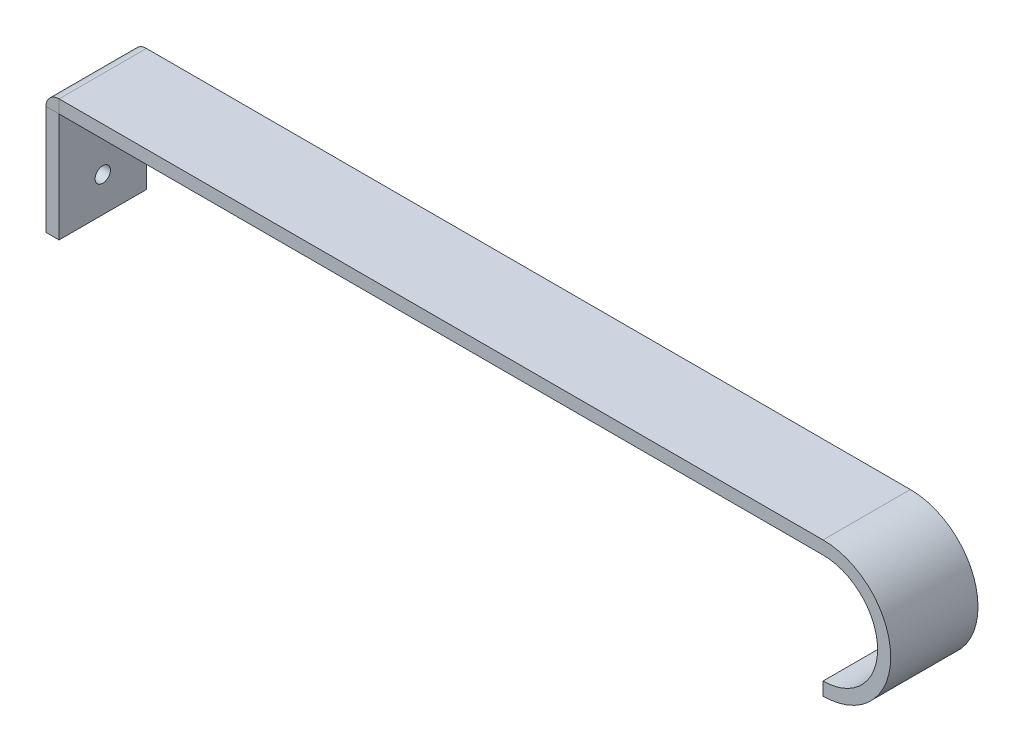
ISO-10303-21;
HEADER;
FILE_DESCRIPTION(('STEP AP214'),'2;1');
FILE_NAME('part.step','',(''),(''),'','','');
FILE_SCHEMA(('AUTOMOTIVE_DESIGN { 1 0 10303 214 1 1 1 1 }'));
ENDSEC;
DATA;
#1=APPLICATION_CONTEXT('core data for automotive mechanical design processes');
#2=APPLICATION_PROTOCOL_DEFINITION('international standard','automotive_design',2000,#1);
#3=PRODUCT_CONTEXT('',#1,'mechanical');
#4=PRODUCT('Part','Part','',(#3));
#5=PRODUCT_RELATED_PRODUCT_CATEGORY('part','',(#4));
#6=PRODUCT_DEFINITION_FORMATION('','',#4);
#7=PRODUCT_DEFINITION_CONTEXT('part definition',#1,'design');
#8=PRODUCT_DEFINITION('design','',#6,#7);
#9=PRODUCT_DEFINITION_SHAPE('','',#8);
#10=(LENGTH_UNIT() NAMED_UNIT(*) SI_UNIT(.MILLI.,.METRE.));
#11=(NAMED_UNIT(*) PLANE_ANGLE_UNIT() SI_UNIT($,.RADIAN.));
#12=(NAMED_UNIT(*) SI_UNIT($,.STERADIAN.) SOLID_ANGLE_UNIT());
#13=UNCERTAINTY_MEASURE_WITH_UNIT(LENGTH_MEASURE(1.E-05),#10,'distance_accuracy_value','');
#14=(GEOMETRIC_REPRESENTATION_CONTEXT(3) GLOBAL_UNCERTAINTY_ASSIGNED_CONTEXT((#13)) GLOBAL_UNIT_ASSIGNED_CONTEXT((#10,
#11,#12)) REPRESENTATION_CONTEXT('',''));
#15=CARTESIAN_POINT('',(0.,0.,0.));
#16=DIRECTION('',(0.,0.,1.));
#17=DIRECTION('',(1.,0.,0.));
#18=AXIS2_PLACEMENT_3D('',#15,#16,#17);
#19=CARTESIAN_POINT('',(22.0000000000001,-24.9999957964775,-20.));
#20=DIRECTION('',(1.,0.,0.));
#21=DIRECTION('',(0.,0.,-1.));
#22=AXIS2_PLACEMENT_3D('',#19,#20,#21);
#23=PLANE('',#22);
#24=CARTESIAN_POINT('',(22.0000000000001,-16.9999957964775,-10.));
#25=DIRECTION('',(-1.,0.,0.));
#26=DIRECTION('',(0.,0.,1.));
#27=AXIS2_PLACEMENT_3D('',#24,#25,#26);
#28=CIRCLE('',#27,1.75);
#29=CARTESIAN_POINT('',(22.0000000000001,-16.9999957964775,-8.25));
#30=VERTEX_POINT('',#29);
#31=EDGE_CURVE('E110',#30,#30,#28,.T.);
#32=ORIENTED_EDGE('',*,*,#31,.F.);
#33=EDGE_LOOP('',(#32));
#34=FACE_BOUND('',#33,.T.);
#35=CARTESIAN_POINT('',(22.,-4.99999579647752,-10.));
#36=DIRECTION('',(-1.,0.,0.));
#37=DIRECTION('',(0.,0.,1.));
#38=AXIS2_PLACEMENT_3D('',#35,#36,#37);
#39=CIRCLE('',#38,1.75);
#40=CARTESIAN_POINT('',(22.,-4.99999579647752,-8.25));
#41=VERTEX_POINT('',#40);
#42=EDGE_CURVE('E189',#41,#41,#39,.T.);
#43=ORIENTED_EDGE('',*,*,#42,.F.);
#44=EDGE_LOOP('',(#43));
#45=FACE_BOUND('',#44,.T.);
#46=DIRECTION('',(0.,1.,0.));
#47=VECTOR('',#46,1.);
#48=CARTESIAN_POINT('',(22.0000000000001,-24.9999957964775,0.));
#49=LINE('',#48,#47);
#50=CARTESIAN_POINT('',(22.0000000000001,-24.9999957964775,0.));
#51=VERTEX_POINT('',#50);
#52=CARTESIAN_POINT('',(22.,-0.000100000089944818,0.));
#53=VERTEX_POINT('',#52);
#54=EDGE_CURVE('E53',#51,#53,#49,.T.);
#55=ORIENTED_EDGE('',*,*,#54,.T.);
#56=DIRECTION('',(0.,0.,-1.));
#57=VECTOR('',#56,1.);
#58=CARTESIAN_POINT('',(22.,-0.000100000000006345,-20.));
#59=LINE('',#58,#57);
#60=CARTESIAN_POINT('',(22.,-0.000100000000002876,-20.));
#61=VERTEX_POINT('',#60);
#62=EDGE_CURVE('E120',#53,#61,#59,.T.);
#63=ORIENTED_EDGE('',*,*,#62,.T.);
#64=DIRECTION('',(0.,-1.,0.));
#65=VECTOR('',#64,1.);
#66=CARTESIAN_POINT('',(22.0000000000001,-24.9999957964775,-20.));
#67=LINE('',#66,#65);
#68=CARTESIAN_POINT('',(22.0000000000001,-24.9999957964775,-20.));
#69=VERTEX_POINT('',#68);
#70=EDGE_CURVE('E75',#61,#69,#67,.T.);
#71=ORIENTED_EDGE('',*,*,#70,.T.);
#72=DIRECTION('',(0.,0.,1.));
#73=VECTOR('',#72,1.);
#74=CARTESIAN_POINT('',(22.0000000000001,-24.9999957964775,0.));
#75=LINE('',#74,#73);
#76=EDGE_CURVE('E96',#69,#51,#75,.T.);
#77=ORIENTED_EDGE('',*,*,#76,.T.);
#78=EDGE_LOOP('',(#55,#63,#71,#77));
#79=FACE_BOUND('',#78,.T.);
#80=ADVANCED_FACE('F49',(#34,#45,#79),#23,.F.);
#81=CARTESIAN_POINT('',(22.0000000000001,-24.9999957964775,0.));
#82=DIRECTION('',(0.,0.,-1.));
#83=DIRECTION('',(0.,-1.,0.));
#84=AXIS2_PLACEMENT_3D('',#81,#82,#83);
#85=PLANE('',#84);
#86=DIRECTION('',(0.,1.,0.));
#87=VECTOR('',#86,1.);
#88=CARTESIAN_POINT('',(25.0000000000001,-24.9999957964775,0.));
#89=LINE('',#88,#87);
#90=CARTESIAN_POINT('',(25.0000000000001,-24.9999957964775,0.));
#91=VERTEX_POINT('',#90);
#92=CARTESIAN_POINT('',(25.,-0.000100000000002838,0.));
#93=VERTEX_POINT('',#92);
#94=EDGE_CURVE('E97',#91,#93,#89,.T.);
#95=ORIENTED_EDGE('',*,*,#94,.T.);
#96=DIRECTION('',(-1.,0.,0.));
#97=VECTOR('',#96,1.);
#98=CARTESIAN_POINT('',(22.,-0.000100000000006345,0.));
#99=LINE('',#98,#97);
#100=EDGE_CURVE('E122',#93,#53,#99,.T.);
#101=ORIENTED_EDGE('',*,*,#100,.T.);
#102=ORIENTED_EDGE('',*,*,#54,.F.);
#103=DIRECTION('',(1.,0.,0.));
#104=VECTOR('',#103,1.);
#105=CARTESIAN_POINT('',(22.0000000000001,-24.9999957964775,0.));
#106=LINE('',#105,#104);
#107=EDGE_CURVE('E104',#51,#91,#106,.T.);
#108=ORIENTED_EDGE('',*,*,#107,.T.);
#109=EDGE_LOOP('',(#95,#101,#102,#108));
#110=FACE_BOUND('',#109,.T.);
#111=ADVANCED_FACE('F129',(#110),#85,.F.);
#112=CARTESIAN_POINT('',(22.0000000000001,-24.9999957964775,-20.));
#113=DIRECTION('',(0.,0.,1.));
#114=DIRECTION('',(0.,1.,0.));
#115=AXIS2_PLACEMENT_3D('',#112,#113,#114);
#116=PLANE('',#115);
#117=ORIENTED_EDGE('',*,*,#70,.F.);
#118=DIRECTION('',(1.,0.,0.));
#119=VECTOR('',#118,1.);
#120=CARTESIAN_POINT('',(22.,-0.000100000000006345,-20.));
#121=LINE('',#120,#119);
#122=CARTESIAN_POINT('',(25.,-9.99999999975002E-05,-20.));
#123=VERTEX_POINT('',#122);
#124=EDGE_CURVE('E14',#61,#123,#121,.T.);
#125=ORIENTED_EDGE('',*,*,#124,.T.);
#126=DIRECTION('',(0.,-1.,0.));
#127=VECTOR('',#126,1.);
#128=CARTESIAN_POINT('',(25.0000000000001,-24.9999957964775,-20.));
#129=LINE('',#128,#127);
#130=CARTESIAN_POINT('',(25.0000000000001,-24.9999957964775,-20.));
#131=VERTEX_POINT('',#130);
#132=EDGE_CURVE('E88',#123,#131,#129,.T.);
#133=ORIENTED_EDGE('',*,*,#132,.T.);
#134=DIRECTION('',(1.,0.,0.));
#135=VECTOR('',#134,1.);
#136=CARTESIAN_POINT('',(22.0000000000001,-24.9999957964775,-20.));
#137=LINE('',#136,#135);
#138=EDGE_CURVE('E90',#69,#131,#137,.T.);
#139=ORIENTED_EDGE('',*,*,#138,.F.);
#140=EDGE_LOOP('',(#117,#125,#133,#139));
#141=FACE_BOUND('',#140,.T.);
#142=ADVANCED_FACE('F51',(#141),#116,.F.);
#143=CARTESIAN_POINT('',(25.0000000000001,-24.9999957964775,-20.));
#144=DIRECTION('',(1.,0.,0.));
#145=DIRECTION('',(0.,0.,-1.));
#146=AXIS2_PLACEMENT_3D('',#143,#144,#145);
#147=PLANE('',#146);
#148=DIRECTION('',(0.,0.,-1.));
#149=VECTOR('',#148,1.);
#150=CARTESIAN_POINT('',(25.,-9.99999999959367E-05,-20.));
#151=LINE('',#150,#149);
#152=EDGE_CURVE('E58',#93,#123,#151,.T.);
#153=ORIENTED_EDGE('',*,*,#152,.F.);
#154=ORIENTED_EDGE('',*,*,#94,.F.);
#155=DIRECTION('',(0.,0.,1.));
#156=VECTOR('',#155,1.);
#157=CARTESIAN_POINT('',(25.0000000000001,-24.9999957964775,0.));
#158=LINE('',#157,#156);
#159=EDGE_CURVE('E103',#131,#91,#158,.T.);
#160=ORIENTED_EDGE('',*,*,#159,.F.);
#161=ORIENTED_EDGE('',*,*,#132,.F.);
#162=EDGE_LOOP('',(#153,#154,#160,#161));
#163=FACE_BOUND('',#162,.T.);
#164=CARTESIAN_POINT('',(25.0000000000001,-16.9999957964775,-10.));
#165=DIRECTION('',(-1.,0.,0.));
#166=DIRECTION('',(0.,0.,1.));
#167=AXIS2_PLACEMENT_3D('',#164,#165,#166);
#168=CIRCLE('',#167,1.75);
#169=CARTESIAN_POINT('',(25.0000000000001,-16.9999957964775,-8.25000000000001));
#170=VERTEX_POINT('',#169);
#171=EDGE_CURVE('E114',#170,#170,#168,.T.);
#172=ORIENTED_EDGE('',*,*,#171,.T.);
#173=EDGE_LOOP('',(#172));
#174=FACE_BOUND('',#173,.T.);
#175=CARTESIAN_POINT('',(25.,-4.99999579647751,-10.));
#176=DIRECTION('',(-1.,0.,0.));
#177=DIRECTION('',(0.,0.,1.));
#178=AXIS2_PLACEMENT_3D('',#175,#176,#177);
#179=CIRCLE('',#178,1.75);
#180=CARTESIAN_POINT('',(25.,-4.99999579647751,-8.25));
#181=VERTEX_POINT('',#180);
#182=EDGE_CURVE('E165',#181,#181,#179,.T.);
#183=ORIENTED_EDGE('',*,*,#182,.T.);
#184=EDGE_LOOP('',(#183));
#185=FACE_BOUND('',#184,.T.);
#186=ADVANCED_FACE('F106',(#163,#174,#185),#147,.T.);
#187=CARTESIAN_POINT('',(22.0000000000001,-24.9999957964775,0.));
#188=DIRECTION('',(0.,1.,0.));
#189=DIRECTION('',(0.,0.,-1.));
#190=AXIS2_PLACEMENT_3D('',#187,#188,#189);
#191=PLANE('',#190);
#192=ORIENTED_EDGE('',*,*,#159,.T.);
#193=ORIENTED_EDGE('',*,*,#107,.F.);
#194=ORIENTED_EDGE('',*,*,#76,.F.);
#195=ORIENTED_EDGE('',*,*,#138,.T.);
#196=EDGE_LOOP('',(#192,#193,#194,#195));
#197=FACE_BOUND('',#196,.T.);
#198=ADVANCED_FACE('F101',(#197),#191,.F.);
#199=CARTESIAN_POINT('',(22.0000000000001,-16.9999957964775,-10.));
#200=DIRECTION('',(1.,0.,0.));
#201=DIRECTION('',(0.,0.,-1.));
#202=AXIS2_PLACEMENT_3D('',#199,#200,#201);
#203=CYLINDRICAL_SURFACE('',#202,1.75);
#204=ORIENTED_EDGE('',*,*,#31,.T.);
#205=EDGE_LOOP('',(#204));
#206=FACE_BOUND('',#205,.T.);
#207=ORIENTED_EDGE('',*,*,#171,.F.);
#208=EDGE_LOOP('',(#207));
#209=FACE_BOUND('',#208,.T.);
#210=ADVANCED_FACE('F197',(#206,#209),#203,.F.);
#211=CARTESIAN_POINT('',(22.,-4.99999579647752,-10.));
#212=DIRECTION('',(1.,0.,0.));
#213=DIRECTION('',(0.,0.,-1.));
#214=AXIS2_PLACEMENT_3D('',#211,#212,#213);
#215=CYLINDRICAL_SURFACE('',#214,1.75);
#216=ORIENTED_EDGE('',*,*,#42,.T.);
#217=EDGE_LOOP('',(#216));
#218=FACE_BOUND('',#217,.T.);
#219=ORIENTED_EDGE('',*,*,#182,.F.);
#220=EDGE_LOOP('',(#219));
#221=FACE_BOUND('',#220,.T.);
#222=ADVANCED_FACE('F199',(#218,#221),#215,.F.);
#223=CARTESIAN_POINT('',(0.,3.,-20.));
#224=DIRECTION('',(0.,-1.,0.));
#225=DIRECTION('',(0.,0.,-1.));
#226=AXIS2_PLACEMENT_3D('',#223,#224,#225);
#227=PLANE('',#226);
#228=DIRECTION('',(0.,0.,-1.));
#229=VECTOR('',#228,1.);
#230=CARTESIAN_POINT('',(25.0001,3.,-20.));
#231=LINE('',#230,#229);
#232=CARTESIAN_POINT('',(25.0001,3.,0.));
#233=VERTEX_POINT('',#232);
#234=CARTESIAN_POINT('',(25.0001,3.,-20.));
#235=VERTEX_POINT('',#234);
#236=EDGE_CURVE('E187',#233,#235,#231,.T.);
#237=ORIENTED_EDGE('',*,*,#236,.F.);
#238=DIRECTION('',(1.,0.,0.));
#239=VECTOR('',#238,1.);
#240=CARTESIAN_POINT('',(0.,3.,0.));
#241=LINE('',#240,#239);
#242=CARTESIAN_POINT('',(200.,3.00000000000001,0.));
#243=VERTEX_POINT('',#242);
#244=EDGE_CURVE('E176',#233,#243,#241,.T.);
#245=ORIENTED_EDGE('',*,*,#244,.T.);
#246=DIRECTION('',(0.,0.,-1.));
#247=VECTOR('',#246,1.);
#248=CARTESIAN_POINT('',(200.,3.,0.));
#249=LINE('',#248,#247);
#250=CARTESIAN_POINT('',(200.,3.00000000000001,-20.));
#251=VERTEX_POINT('',#250);
#252=EDGE_CURVE('E173',#243,#251,#249,.T.);
#253=ORIENTED_EDGE('',*,*,#252,.T.);
#254=DIRECTION('',(-1.,0.,0.));
#255=VECTOR('',#254,1.);
#256=CARTESIAN_POINT('',(0.,3.,-20.));
#257=LINE('',#256,#255);
#258=EDGE_CURVE('E170',#251,#235,#257,.T.);
#259=ORIENTED_EDGE('',*,*,#258,.T.);
#260=EDGE_LOOP('',(#237,#245,#253,#259));
#261=FACE_BOUND('',#260,.T.);
#262=ADVANCED_FACE('F206',(#261),#227,.F.);
#263=CARTESIAN_POINT('',(0.,3.,0.));
#264=DIRECTION('',(0.,0.,-1.));
#265=DIRECTION('',(-1.,0.,0.));
#266=AXIS2_PLACEMENT_3D('',#263,#264,#265);
#267=PLANE('',#266);
#268=DIRECTION('',(0.,1.,0.));
#269=VECTOR('',#268,1.);
#270=CARTESIAN_POINT('',(25.0001,3.,0.));
#271=LINE('',#270,#269);
#272=CARTESIAN_POINT('',(25.0001,0.,0.));
#273=VERTEX_POINT('',#272);
#274=EDGE_CURVE('E182',#273,#233,#271,.T.);
#275=ORIENTED_EDGE('',*,*,#274,.F.);
#276=DIRECTION('',(1.,0.,0.));
#277=VECTOR('',#276,1.);
#278=CARTESIAN_POINT('',(0.,0.,0.));
#279=LINE('',#278,#277);
#280=CARTESIAN_POINT('',(200.,0.,0.));
#281=VERTEX_POINT('',#280);
#282=EDGE_CURVE('E167',#273,#281,#279,.T.);
#283=ORIENTED_EDGE('',*,*,#282,.T.);
#284=CARTESIAN_POINT('',(200.,-12.4999978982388,0.));
#285=DIRECTION('',(0.,0.,-1.));
#286=DIRECTION('',(1.,0.,0.));
#287=AXIS2_PLACEMENT_3D('',#284,#285,#286);
#288=CIRCLE('',#287,12.4999978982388);
#289=CARTESIAN_POINT('',(200.,-24.9999957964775,0.));
#290=VERTEX_POINT('',#289);
#291=EDGE_CURVE('E417',#281,#290,#288,.T.);
#292=ORIENTED_EDGE('',*,*,#291,.T.);
#293=DIRECTION('',(0.,-1.,0.));
#294=VECTOR('',#293,1.);
#295=CARTESIAN_POINT('',(200.,-24.9999957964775,0.));
#296=LINE('',#295,#294);
#297=CARTESIAN_POINT('',(200.,-27.9999957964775,0.));
#298=VERTEX_POINT('',#297);
#299=EDGE_CURVE('E414',#290,#298,#296,.T.);
#300=ORIENTED_EDGE('',*,*,#299,.T.);
#301=CARTESIAN_POINT('',(200.,-12.4999978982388,0.));
#302=DIRECTION('',(0.,0.,1.));
#303=DIRECTION('',(1.,0.,0.));
#304=AXIS2_PLACEMENT_3D('',#301,#302,#303);
#305=CIRCLE('',#304,15.4999978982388);
#306=EDGE_CURVE('E410',#298,#243,#305,.T.);
#307=ORIENTED_EDGE('',*,*,#306,.T.);
#308=ORIENTED_EDGE('',*,*,#244,.F.);
#309=EDGE_LOOP('',(#275,#283,#292,#300,#307,#308));
#310=FACE_BOUND('',#309,.T.);
#311=ADVANCED_FACE('F265',(#310),#267,.F.);
#312=CARTESIAN_POINT('',(0.,0.,-20.));
#313=DIRECTION('',(0.,-1.,0.));
#314=DIRECTION('',(0.,0.,-1.));
#315=AXIS2_PLACEMENT_3D('',#312,#313,#314);
#316=PLANE('',#315);
#317=ORIENTED_EDGE('',*,*,#282,.F.);
#318=DIRECTION('',(0.,0.,-1.));
#319=VECTOR('',#318,1.);
#320=CARTESIAN_POINT('',(25.0001,0.,-20.));
#321=LINE('',#320,#319);
#322=CARTESIAN_POINT('',(25.0001,0.,-20.));
#323=VERTEX_POINT('',#322);
#324=EDGE_CURVE('E151',#273,#323,#321,.T.);
#325=ORIENTED_EDGE('',*,*,#324,.T.);
#326=DIRECTION('',(-1.,0.,0.));
#327=VECTOR('',#326,1.);
#328=CARTESIAN_POINT('',(0.,0.,-20.));
#329=LINE('',#328,#327);
#330=CARTESIAN_POINT('',(200.,0.,-20.));
#331=VERTEX_POINT('',#330);
#332=EDGE_CURVE('E162',#331,#323,#329,.T.);
#333=ORIENTED_EDGE('',*,*,#332,.F.);
#334=DIRECTION('',(0.,0.,-1.));
#335=VECTOR('',#334,1.);
#336=CARTESIAN_POINT('',(200.,0.,0.));
#337=LINE('',#336,#335);
#338=EDGE_CURVE('E179',#281,#331,#337,.T.);
#339=ORIENTED_EDGE('',*,*,#338,.F.);
#340=EDGE_LOOP('',(#317,#325,#333,#339));
#341=FACE_BOUND('',#340,.T.);
#342=ADVANCED_FACE('F258',(#341),#316,.T.);
#343=CARTESIAN_POINT('',(0.,3.,-20.));
#344=DIRECTION('',(0.,0.,1.));
#345=DIRECTION('',(1.,0.,0.));
#346=AXIS2_PLACEMENT_3D('',#343,#344,#345);
#347=PLANE('',#346);
#348=DIRECTION('',(0.,-1.,0.));
#349=VECTOR('',#348,1.);
#350=CARTESIAN_POINT('',(25.0001,3.,-20.));
#351=LINE('',#350,#349);
#352=EDGE_CURVE('E184',#235,#323,#351,.T.);
#353=ORIENTED_EDGE('',*,*,#352,.F.);
#354=ORIENTED_EDGE('',*,*,#258,.F.);
#355=CARTESIAN_POINT('',(200.,-12.4999978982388,-20.));
#356=DIRECTION('',(0.,0.,1.));
#357=DIRECTION('',(1.,0.,0.));
#358=AXIS2_PLACEMENT_3D('',#355,#356,#357);
#359=CIRCLE('',#358,15.4999978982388);
#360=CARTESIAN_POINT('',(200.,-27.9999957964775,-20.));
#361=VERTEX_POINT('',#360);
#362=EDGE_CURVE('E408',#361,#251,#359,.T.);
#363=ORIENTED_EDGE('',*,*,#362,.F.);
#364=DIRECTION('',(0.,-1.,0.));
#365=VECTOR('',#364,1.);
#366=CARTESIAN_POINT('',(200.,-24.9999957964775,-20.));
#367=LINE('',#366,#365);
#368=CARTESIAN_POINT('',(200.,-24.9999957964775,-20.));
#369=VERTEX_POINT('',#368);
#370=EDGE_CURVE('E422',#369,#361,#367,.T.);
#371=ORIENTED_EDGE('',*,*,#370,.F.);
#372=CARTESIAN_POINT('',(200.,-12.4999978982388,-20.));
#373=DIRECTION('',(0.,0.,-1.));
#374=DIRECTION('',(1.,0.,0.));
#375=AXIS2_PLACEMENT_3D('',#372,#373,#374);
#376=CIRCLE('',#375,12.4999978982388);
#377=EDGE_CURVE('E413',#331,#369,#376,.T.);
#378=ORIENTED_EDGE('',*,*,#377,.F.);
#379=ORIENTED_EDGE('',*,*,#332,.T.);
#380=EDGE_LOOP('',(#353,#354,#363,#371,#378,#379));
#381=FACE_BOUND('',#380,.T.);
#382=ADVANCED_FACE('F244',(#381),#347,.F.);
#383=CARTESIAN_POINT('',(25.0001,-9.99999999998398E-05,0.));
#384=DIRECTION('',(0.,0.,1.));
#385=DIRECTION('',(1.,0.,0.));
#386=AXIS2_PLACEMENT_3D('',#383,#384,#385);
#387=PLANE('',#386);
#388=ORIENTED_EDGE('',*,*,#100,.F.);
#389=CARTESIAN_POINT('',(25.0001,-9.99999999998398E-05,0.));
#390=DIRECTION('',(0.,0.,1.));
#391=DIRECTION('',(1.,0.,0.));
#392=AXIS2_PLACEMENT_3D('',#389,#390,#391);
#393=CIRCLE('',#392,9.99999999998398E-05);
#394=EDGE_CURVE('E141',#93,#273,#393,.F.);
#395=ORIENTED_EDGE('',*,*,#394,.T.);
#396=ORIENTED_EDGE('',*,*,#274,.T.);
#397=CARTESIAN_POINT('',(25.0001,-9.99999999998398E-05,0.));
#398=DIRECTION('',(0.,0.,-1.));
#399=DIRECTION('',(-1.,0.,0.));
#400=AXIS2_PLACEMENT_3D('',#397,#398,#399);
#401=CIRCLE('',#400,3.0001);
#402=EDGE_CURVE('E143',#53,#233,#401,.T.);
#403=ORIENTED_EDGE('',*,*,#402,.F.);
#404=EDGE_LOOP('',(#388,#395,#396,#403));
#405=FACE_BOUND('',#404,.T.);
#406=ADVANCED_FACE('F138',(#405),#387,.T.);
#407=CARTESIAN_POINT('',(25.0001,-9.99999999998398E-05,-20.));
#408=DIRECTION('',(0.,0.,-1.));
#409=DIRECTION('',(-1.,0.,0.));
#410=AXIS2_PLACEMENT_3D('',#407,#408,#409);
#411=PLANE('',#410);
#412=CARTESIAN_POINT('',(25.0001,-9.99999999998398E-05,-20.));
#413=DIRECTION('',(0.,0.,1.));
#414=DIRECTION('',(1.,0.,0.));
#415=AXIS2_PLACEMENT_3D('',#412,#413,#414);
#416=CIRCLE('',#415,9.99999999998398E-05);
#417=EDGE_CURVE('E152',#323,#123,#416,.T.);
#418=ORIENTED_EDGE('',*,*,#417,.T.);
#419=ORIENTED_EDGE('',*,*,#124,.F.);
#420=CARTESIAN_POINT('',(25.0001,-9.99999999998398E-05,-20.));
#421=DIRECTION('',(0.,0.,1.));
#422=DIRECTION('',(1.,0.,0.));
#423=AXIS2_PLACEMENT_3D('',#420,#421,#422);
#424=CIRCLE('',#423,3.0001);
#425=EDGE_CURVE('E66',#235,#61,#424,.T.);
#426=ORIENTED_EDGE('',*,*,#425,.F.);
#427=ORIENTED_EDGE('',*,*,#352,.T.);
#428=EDGE_LOOP('',(#418,#419,#426,#427));
#429=FACE_BOUND('',#428,.T.);
#430=ADVANCED_FACE('F279',(#429),#411,.T.);
#431=CARTESIAN_POINT('',(25.0001,-9.99999999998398E-05,-30.2237484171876));
#432=DIRECTION('',(0.,0.,1.));
#433=DIRECTION('',(1.,0.,0.));
#434=AXIS2_PLACEMENT_3D('',#431,#432,#433);
#435=CYLINDRICAL_SURFACE('',#434,3.0001);
#436=ORIENTED_EDGE('',*,*,#236,.T.);
#437=ORIENTED_EDGE('',*,*,#425,.T.);
#438=ORIENTED_EDGE('',*,*,#62,.F.);
#439=ORIENTED_EDGE('',*,*,#402,.T.);
#440=EDGE_LOOP('',(#436,#437,#438,#439));
#441=FACE_BOUND('',#440,.T.);
#442=ADVANCED_FACE('F281',(#441),#435,.T.);
#443=CARTESIAN_POINT('',(25.0001,-9.99999999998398E-05,-30.2237484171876));
#444=DIRECTION('',(0.,0.,1.));
#445=DIRECTION('',(1.,0.,0.));
#446=AXIS2_PLACEMENT_3D('',#443,#444,#445);
#447=CYLINDRICAL_SURFACE('',#446,9.99999999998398E-05);
#448=ORIENTED_EDGE('',*,*,#324,.F.);
#449=ORIENTED_EDGE('',*,*,#394,.F.);
#450=ORIENTED_EDGE('',*,*,#152,.T.);
#451=ORIENTED_EDGE('',*,*,#417,.F.);
#452=EDGE_LOOP('',(#448,#449,#450,#451));
#453=FACE_BOUND('',#452,.T.);
#454=ADVANCED_FACE('F147',(#453),#447,.F.);
#455=CARTESIAN_POINT('',(200.,-12.4999978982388,-20.));
#456=DIRECTION('',(0.,0.,1.));
#457=DIRECTION('',(1.,0.,0.));
#458=AXIS2_PLACEMENT_3D('',#455,#456,#457);
#459=CYLINDRICAL_SURFACE('',#458,12.4999978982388);
#460=ORIENTED_EDGE('',*,*,#291,.F.);
#461=ORIENTED_EDGE('',*,*,#338,.T.);
#462=ORIENTED_EDGE('',*,*,#377,.T.);
#463=DIRECTION('',(0.,0.,1.));
#464=VECTOR('',#463,1.);
#465=CARTESIAN_POINT('',(200.,-24.9999957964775,-20.));
#466=LINE('',#465,#464);
#467=EDGE_CURVE('E157',#369,#290,#466,.T.);
#468=ORIENTED_EDGE('',*,*,#467,.T.);
#469=EDGE_LOOP('',(#460,#461,#462,#468));
#470=FACE_BOUND('',#469,.T.);
#471=ADVANCED_FACE('F310',(#470),#459,.F.);
#472=CARTESIAN_POINT('',(200.,-12.4999978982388,-20.));
#473=DIRECTION('',(0.,0.,1.));
#474=DIRECTION('',(1.,0.,0.));
#475=AXIS2_PLACEMENT_3D('',#472,#473,#474);
#476=CYLINDRICAL_SURFACE('',#475,15.4999978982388);
#477=ORIENTED_EDGE('',*,*,#306,.F.);
#478=DIRECTION('',(0.,0.,1.));
#479=VECTOR('',#478,1.);
#480=CARTESIAN_POINT('',(200.,-27.9999957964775,-20.));
#481=LINE('',#480,#479);
#482=EDGE_CURVE('E153',#361,#298,#481,.T.);
#483=ORIENTED_EDGE('',*,*,#482,.F.);
#484=ORIENTED_EDGE('',*,*,#362,.T.);
#485=ORIENTED_EDGE('',*,*,#252,.F.);
#486=EDGE_LOOP('',(#477,#483,#484,#485));
#487=FACE_BOUND('',#486,.T.);
#488=ADVANCED_FACE('F335',(#487),#476,.T.);
#489=CARTESIAN_POINT('',(200.,-24.9999957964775,-20.));
#490=DIRECTION('',(-1.,0.,0.));
#491=DIRECTION('',(0.,0.,1.));
#492=AXIS2_PLACEMENT_3D('',#489,#490,#491);
#493=PLANE('',#492);
#494=ORIENTED_EDGE('',*,*,#299,.F.);
#495=ORIENTED_EDGE('',*,*,#467,.F.);
#496=ORIENTED_EDGE('',*,*,#370,.T.);
#497=ORIENTED_EDGE('',*,*,#482,.T.);
#498=EDGE_LOOP('',(#494,#495,#496,#497));
#499=FACE_BOUND('',#498,.T.);
#500=ADVANCED_FACE('F344',(#499),#493,.T.);
#501=CLOSED_SHELL('',(#80,#111,#142,#186,#198,#210,#222,#262,#311,#342,#382,#406,#430,#442,#454,
#471,#488,#500));
#502=MANIFOLD_SOLID_BREP('B2',#501);
#503=ADVANCED_BREP_SHAPE_REPRESENTATION('',(#18,#502),#14);
#504=SHAPE_DEFINITION_REPRESENTATION(#9,#503);
ENDSEC;
END-ISO-10303-21;
